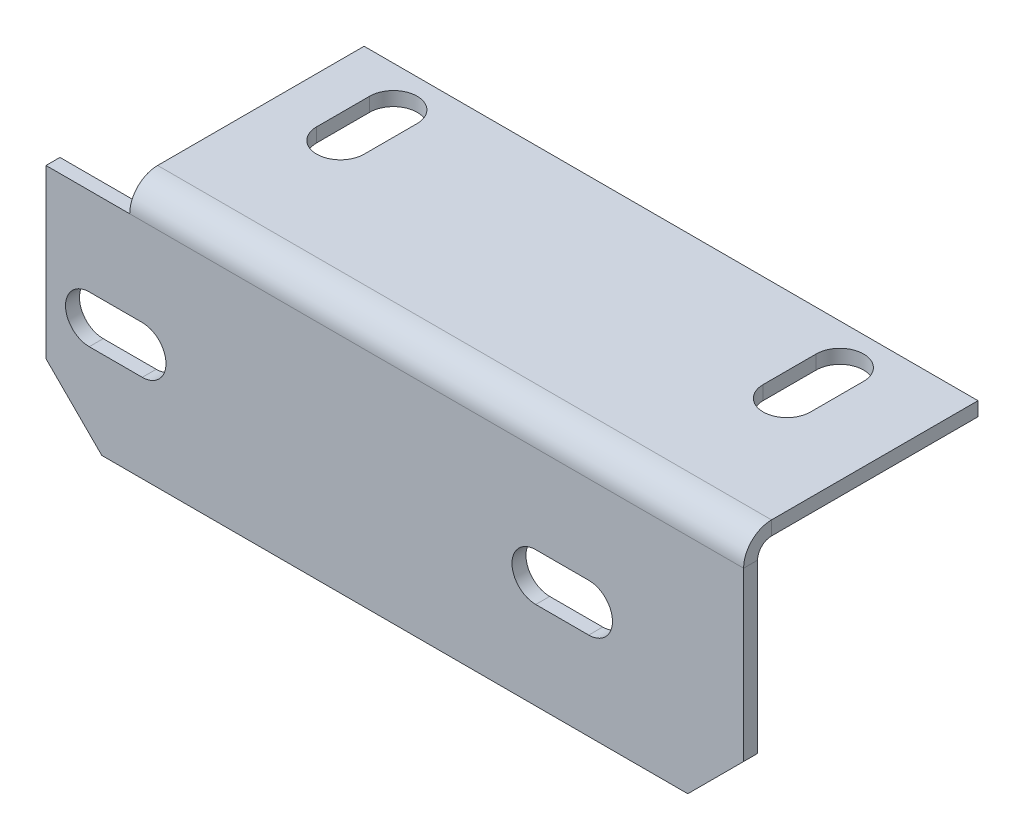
ISO-10303-21;
HEADER;
FILE_DESCRIPTION(('STEP AP214'),'2;1');
FILE_NAME('part.step','',(''),(''),'','','');
FILE_SCHEMA(('AUTOMOTIVE_DESIGN { 1 0 10303 214 1 1 1 1 }'));
ENDSEC;
DATA;
#1=APPLICATION_CONTEXT('core data for automotive mechanical design processes');
#2=APPLICATION_PROTOCOL_DEFINITION('international standard','automotive_design',2000,#1);
#3=PRODUCT_CONTEXT('',#1,'mechanical');
#4=PRODUCT('Part','Part','',(#3));
#5=PRODUCT_RELATED_PRODUCT_CATEGORY('part','',(#4));
#6=PRODUCT_DEFINITION_FORMATION('','',#4);
#7=PRODUCT_DEFINITION_CONTEXT('part definition',#1,'design');
#8=PRODUCT_DEFINITION('design','',#6,#7);
#9=PRODUCT_DEFINITION_SHAPE('','',#8);
#10=(LENGTH_UNIT() NAMED_UNIT(*) SI_UNIT(.MILLI.,.METRE.));
#11=(NAMED_UNIT(*) PLANE_ANGLE_UNIT() SI_UNIT($,.RADIAN.));
#12=(NAMED_UNIT(*) SI_UNIT($,.STERADIAN.) SOLID_ANGLE_UNIT());
#13=UNCERTAINTY_MEASURE_WITH_UNIT(LENGTH_MEASURE(1.E-05),#10,'distance_accuracy_value','');
#14=(GEOMETRIC_REPRESENTATION_CONTEXT(3) GLOBAL_UNCERTAINTY_ASSIGNED_CONTEXT((#13)) GLOBAL_UNIT_ASSIGNED_CONTEXT((#10,
#11,#12)) REPRESENTATION_CONTEXT('',''));
#15=CARTESIAN_POINT('',(0.,0.,0.));
#16=DIRECTION('',(0.,0.,1.));
#17=DIRECTION('',(1.,0.,0.));
#18=AXIS2_PLACEMENT_3D('',#15,#16,#17);
#19=CARTESIAN_POINT('',(62.4999999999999,45.,-5.00000000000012));
#20=DIRECTION('',(1.,0.,0.));
#21=DIRECTION('',(0.,0.,-1.));
#22=AXIS2_PLACEMENT_3D('',#19,#20,#21);
#23=PLANE('',#22);
#24=DIRECTION('',(0.,-1.,0.));
#25=VECTOR('',#24,1.);
#26=CARTESIAN_POINT('',(62.4999999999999,45.,-5.00000000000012));
#27=LINE('',#26,#25);
#28=CARTESIAN_POINT('',(62.4999999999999,45.,-5.00000000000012));
#29=VERTEX_POINT('',#28);
#30=CARTESIAN_POINT('',(62.4999999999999,42.5,-4.99999999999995));
#31=VERTEX_POINT('',#30);
#32=EDGE_CURVE('E273',#29,#31,#27,.T.);
#33=ORIENTED_EDGE('',*,*,#32,.F.);
#34=CARTESIAN_POINT('',(62.4999999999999,40.,-4.99999999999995));
#35=DIRECTION('',(1.,0.,0.));
#36=DIRECTION('',(0.,0.,-1.));
#37=AXIS2_PLACEMENT_3D('',#34,#35,#36);
#38=CIRCLE('',#37,5.);
#39=CARTESIAN_POINT('',(62.5,39.9999999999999,0.));
#40=VERTEX_POINT('',#39);
#41=EDGE_CURVE('E358',#40,#29,#38,.F.);
#42=ORIENTED_EDGE('',*,*,#41,.F.);
#43=DIRECTION('',(0.,0.,1.));
#44=VECTOR('',#43,1.);
#45=CARTESIAN_POINT('',(62.5,40.,-2.49999999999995));
#46=LINE('',#45,#44);
#47=CARTESIAN_POINT('',(62.5,40.,-2.49999999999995));
#48=VERTEX_POINT('',#47);
#49=EDGE_CURVE('E269',#48,#40,#46,.T.);
#50=ORIENTED_EDGE('',*,*,#49,.F.);
#51=CARTESIAN_POINT('',(62.4999999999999,40.,-4.99999999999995));
#52=DIRECTION('',(1.,0.,0.));
#53=DIRECTION('',(0.,0.,-1.));
#54=AXIS2_PLACEMENT_3D('',#51,#52,#53);
#55=CIRCLE('',#54,2.5);
#56=EDGE_CURVE('E348',#48,#31,#55,.F.);
#57=ORIENTED_EDGE('',*,*,#56,.T.);
#58=EDGE_LOOP('',(#33,#42,#50,#57));
#59=FACE_BOUND('',#58,.T.);
#60=ADVANCED_FACE('F44',(#59),#23,.T.);
#61=CARTESIAN_POINT('',(62.5,40.,-2.49999999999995));
#62=DIRECTION('',(1.,0.,0.));
#63=DIRECTION('',(0.,0.,-1.));
#64=AXIS2_PLACEMENT_3D('',#61,#62,#63);
#65=PLANE('',#64);
#66=DIRECTION('',(0.,0.,-1.));
#67=VECTOR('',#66,1.);
#68=CARTESIAN_POINT('',(62.5,45.,-1.11022302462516E-13));
#69=LINE('',#68,#67);
#70=CARTESIAN_POINT('',(62.4999999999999,45.,-42.0000000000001));
#71=VERTEX_POINT('',#70);
#72=EDGE_CURVE('E252',#29,#71,#69,.T.);
#73=ORIENTED_EDGE('',*,*,#72,.F.);
#74=ORIENTED_EDGE('',*,*,#32,.T.);
#75=DIRECTION('',(0.,0.,-1.));
#76=VECTOR('',#75,1.);
#77=CARTESIAN_POINT('',(62.5,42.5,0.));
#78=LINE('',#77,#76);
#79=CARTESIAN_POINT('',(62.4999999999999,42.5,-42.));
#80=VERTEX_POINT('',#79);
#81=EDGE_CURVE('E318',#31,#80,#78,.T.);
#82=ORIENTED_EDGE('',*,*,#81,.T.);
#83=DIRECTION('',(0.,-1.,0.));
#84=VECTOR('',#83,1.);
#85=CARTESIAN_POINT('',(62.4999999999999,45.,-42.0000000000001));
#86=LINE('',#85,#84);
#87=EDGE_CURVE('E364',#71,#80,#86,.T.);
#88=ORIENTED_EDGE('',*,*,#87,.F.);
#89=EDGE_LOOP('',(#73,#74,#82,#88));
#90=FACE_BOUND('',#89,.T.);
#91=ADVANCED_FACE('F568',(#90),#65,.T.);
#92=CARTESIAN_POINT('',(-62.5,42.5,-4.99999999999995));
#93=DIRECTION('',(-1.,0.,0.));
#94=DIRECTION('',(0.,0.,1.));
#95=AXIS2_PLACEMENT_3D('',#92,#93,#94);
#96=PLANE('',#95);
#97=DIRECTION('',(0.,1.,0.));
#98=VECTOR('',#97,1.);
#99=CARTESIAN_POINT('',(-62.5,0.,-2.5));
#100=LINE('',#99,#98);
#101=CARTESIAN_POINT('',(-62.5,10.,-2.5));
#102=VERTEX_POINT('',#101);
#103=CARTESIAN_POINT('',(-62.5,40.,-2.49999999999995));
#104=VERTEX_POINT('',#103);
#105=EDGE_CURVE('E307',#102,#104,#100,.T.);
#106=ORIENTED_EDGE('',*,*,#105,.F.);
#107=DIRECTION('',(0.,0.,1.));
#108=VECTOR('',#107,1.);
#109=CARTESIAN_POINT('',(-62.5,10.,-4.99999999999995));
#110=LINE('',#109,#108);
#111=CARTESIAN_POINT('',(-62.5,10.,0.));
#112=VERTEX_POINT('',#111);
#113=EDGE_CURVE('E289',#102,#112,#110,.T.);
#114=ORIENTED_EDGE('',*,*,#113,.T.);
#115=DIRECTION('',(0.,1.,0.));
#116=VECTOR('',#115,1.);
#117=CARTESIAN_POINT('',(-62.5,0.,0.));
#118=LINE('',#117,#116);
#119=CARTESIAN_POINT('',(-62.5,40.,0.));
#120=VERTEX_POINT('',#119);
#121=EDGE_CURVE('E319',#112,#120,#118,.T.);
#122=ORIENTED_EDGE('',*,*,#121,.T.);
#123=DIRECTION('',(0.,0.,-1.));
#124=VECTOR('',#123,1.);
#125=CARTESIAN_POINT('',(-62.5,39.9999999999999,0.));
#126=LINE('',#125,#124);
#127=EDGE_CURVE('E259',#120,#104,#126,.T.);
#128=ORIENTED_EDGE('',*,*,#127,.T.);
#129=EDGE_LOOP('',(#106,#114,#122,#128));
#130=FACE_BOUND('',#129,.T.);
#131=ADVANCED_FACE('F314',(#130),#96,.T.);
#132=CARTESIAN_POINT('',(62.5,42.5,0.));
#133=DIRECTION('',(0.,1.,0.));
#134=DIRECTION('',(0.,0.,1.));
#135=AXIS2_PLACEMENT_3D('',#132,#133,#134);
#136=PLANE('',#135);
#137=DIRECTION('',(0.,0.,1.));
#138=VECTOR('',#137,1.);
#139=CARTESIAN_POINT('',(-30.75,42.5,-34.7500000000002));
#140=LINE('',#139,#138);
#141=CARTESIAN_POINT('',(-30.75,42.5,-34.7500000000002));
#142=VERTEX_POINT('',#141);
#143=CARTESIAN_POINT('',(-30.75,42.5,-25.2500000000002));
#144=VERTEX_POINT('',#143);
#145=EDGE_CURVE('E523',#142,#144,#140,.T.);
#146=ORIENTED_EDGE('',*,*,#145,.F.);
#147=CARTESIAN_POINT('',(-35.,42.5,-34.75));
#148=DIRECTION('',(0.,-1.,0.));
#149=DIRECTION('',(0.,0.,1.));
#150=AXIS2_PLACEMENT_3D('',#147,#148,#149);
#151=CIRCLE('',#150,4.25);
#152=CARTESIAN_POINT('',(-39.25,42.5,-34.75));
#153=VERTEX_POINT('',#152);
#154=EDGE_CURVE('E67',#153,#142,#151,.T.);
#155=ORIENTED_EDGE('',*,*,#154,.F.);
#156=DIRECTION('',(0.,0.,-1.));
#157=VECTOR('',#156,1.);
#158=CARTESIAN_POINT('',(-39.25,42.5,-34.75));
#159=LINE('',#158,#157);
#160=CARTESIAN_POINT('',(-39.25,42.5,-25.25));
#161=VERTEX_POINT('',#160);
#162=EDGE_CURVE('E508',#161,#153,#159,.T.);
#163=ORIENTED_EDGE('',*,*,#162,.F.);
#164=CARTESIAN_POINT('',(-35.,42.5,-25.25));
#165=DIRECTION('',(0.,-1.,0.));
#166=DIRECTION('',(0.,0.,-1.));
#167=AXIS2_PLACEMENT_3D('',#164,#165,#166);
#168=CIRCLE('',#167,4.25);
#169=EDGE_CURVE('E519',#144,#161,#168,.T.);
#170=ORIENTED_EDGE('',*,*,#169,.F.);
#171=EDGE_LOOP('',(#146,#155,#163,#170));
#172=FACE_BOUND('',#171,.T.);
#173=DIRECTION('',(0.,0.,1.));
#174=VECTOR('',#173,1.);
#175=CARTESIAN_POINT('',(49.2499999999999,42.5,-34.7500000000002));
#176=LINE('',#175,#174);
#177=CARTESIAN_POINT('',(49.2499999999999,42.5,-34.7500000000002));
#178=VERTEX_POINT('',#177);
#179=CARTESIAN_POINT('',(49.25,42.5,-25.2500000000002));
#180=VERTEX_POINT('',#179);
#181=EDGE_CURVE('E438',#178,#180,#176,.T.);
#182=ORIENTED_EDGE('',*,*,#181,.F.);
#183=CARTESIAN_POINT('',(44.9999999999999,42.5,-34.75));
#184=DIRECTION('',(0.,-1.,0.));
#185=DIRECTION('',(0.,0.,1.));
#186=AXIS2_PLACEMENT_3D('',#183,#184,#185);
#187=CIRCLE('',#186,4.25);
#188=CARTESIAN_POINT('',(40.7499999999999,42.5,-34.7500000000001));
#189=VERTEX_POINT('',#188);
#190=EDGE_CURVE('E442',#189,#178,#187,.T.);
#191=ORIENTED_EDGE('',*,*,#190,.F.);
#192=DIRECTION('',(0.,0.,-1.));
#193=VECTOR('',#192,1.);
#194=CARTESIAN_POINT('',(40.7499999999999,42.5,-34.7500000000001));
#195=LINE('',#194,#193);
#196=CARTESIAN_POINT('',(40.75,42.5,-25.25));
#197=VERTEX_POINT('',#196);
#198=EDGE_CURVE('E424',#197,#189,#195,.T.);
#199=ORIENTED_EDGE('',*,*,#198,.F.);
#200=CARTESIAN_POINT('',(45.,42.5,-25.25));
#201=DIRECTION('',(0.,-1.,0.));
#202=DIRECTION('',(0.,0.,-1.));
#203=AXIS2_PLACEMENT_3D('',#200,#201,#202);
#204=CIRCLE('',#203,4.25);
#205=EDGE_CURVE('E434',#180,#197,#204,.T.);
#206=ORIENTED_EDGE('',*,*,#205,.F.);
#207=EDGE_LOOP('',(#182,#191,#199,#206));
#208=FACE_BOUND('',#207,.T.);
#209=DIRECTION('',(-1.,0.,0.));
#210=VECTOR('',#209,1.);
#211=CARTESIAN_POINT('',(62.4999999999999,42.5,-4.99999999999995));
#212=LINE('',#211,#210);
#213=CARTESIAN_POINT('',(-47.5,42.5,-5.));
#214=VERTEX_POINT('',#213);
#215=EDGE_CURVE('E344',#31,#214,#212,.T.);
#216=ORIENTED_EDGE('',*,*,#215,.T.);
#217=DIRECTION('',(0.,0.,-1.));
#218=VECTOR('',#217,1.);
#219=CARTESIAN_POINT('',(-47.5,42.5,0.));
#220=LINE('',#219,#218);
#221=CARTESIAN_POINT('',(-47.5,42.5,-42.));
#222=VERTEX_POINT('',#221);
#223=EDGE_CURVE('E246',#214,#222,#220,.T.);
#224=ORIENTED_EDGE('',*,*,#223,.T.);
#225=DIRECTION('',(-1.,0.,0.));
#226=VECTOR('',#225,1.);
#227=CARTESIAN_POINT('',(62.4999999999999,42.5,-42.));
#228=LINE('',#227,#226);
#229=EDGE_CURVE('E244',#80,#222,#228,.T.);
#230=ORIENTED_EDGE('',*,*,#229,.F.);
#231=ORIENTED_EDGE('',*,*,#81,.F.);
#232=EDGE_LOOP('',(#216,#224,#230,#231));
#233=FACE_BOUND('',#232,.T.);
#234=ADVANCED_FACE('F566',(#172,#208,#233),#136,.F.);
#235=CARTESIAN_POINT('',(62.4999999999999,45.,-42.0000000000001));
#236=DIRECTION('',(0.,0.,-1.));
#237=DIRECTION('',(-1.,0.,0.));
#238=AXIS2_PLACEMENT_3D('',#235,#236,#237);
#239=PLANE('',#238);
#240=DIRECTION('',(0.,1.,0.));
#241=VECTOR('',#240,1.);
#242=CARTESIAN_POINT('',(-47.5,40.,-42.));
#243=LINE('',#242,#241);
#244=CARTESIAN_POINT('',(-47.5,45.,-42.));
#245=VERTEX_POINT('',#244);
#246=EDGE_CURVE('E226',#222,#245,#243,.T.);
#247=ORIENTED_EDGE('',*,*,#246,.T.);
#248=DIRECTION('',(-1.,0.,0.));
#249=VECTOR('',#248,1.);
#250=CARTESIAN_POINT('',(62.4999999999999,45.,-42.0000000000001));
#251=LINE('',#250,#249);
#252=EDGE_CURVE('E241',#71,#245,#251,.T.);
#253=ORIENTED_EDGE('',*,*,#252,.F.);
#254=ORIENTED_EDGE('',*,*,#87,.T.);
#255=ORIENTED_EDGE('',*,*,#229,.T.);
#256=EDGE_LOOP('',(#247,#253,#254,#255));
#257=FACE_BOUND('',#256,.T.);
#258=ADVANCED_FACE('F239',(#257),#239,.T.);
#259=CARTESIAN_POINT('',(62.5,45.,-1.11022302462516E-13));
#260=DIRECTION('',(0.,1.,0.));
#261=DIRECTION('',(0.,0.,1.));
#262=AXIS2_PLACEMENT_3D('',#259,#260,#261);
#263=PLANE('',#262);
#264=DIRECTION('',(0.,0.,-1.));
#265=VECTOR('',#264,1.);
#266=CARTESIAN_POINT('',(-47.5,45.,-42.));
#267=LINE('',#266,#265);
#268=CARTESIAN_POINT('',(-47.5,45.,-5.));
#269=VERTEX_POINT('',#268);
#270=EDGE_CURVE('E223',#269,#245,#267,.T.);
#271=ORIENTED_EDGE('',*,*,#270,.F.);
#272=DIRECTION('',(-1.,0.,0.));
#273=VECTOR('',#272,1.);
#274=CARTESIAN_POINT('',(62.4999999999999,45.,-5.00000000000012));
#275=LINE('',#274,#273);
#276=EDGE_CURVE('E254',#29,#269,#275,.T.);
#277=ORIENTED_EDGE('',*,*,#276,.F.);
#278=ORIENTED_EDGE('',*,*,#72,.T.);
#279=ORIENTED_EDGE('',*,*,#252,.T.);
#280=EDGE_LOOP('',(#271,#277,#278,#279));
#281=FACE_BOUND('',#280,.T.);
#282=CARTESIAN_POINT('',(-35.,45.,-34.75));
#283=DIRECTION('',(0.,1.,0.));
#284=DIRECTION('',(0.,0.,1.));
#285=AXIS2_PLACEMENT_3D('',#282,#283,#284);
#286=CIRCLE('',#285,4.25);
#287=CARTESIAN_POINT('',(-39.25,45.,-34.75));
#288=VERTEX_POINT('',#287);
#289=CARTESIAN_POINT('',(-30.75,45.,-34.7500000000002));
#290=VERTEX_POINT('',#289);
#291=EDGE_CURVE('E529',#288,#290,#286,.F.);
#292=ORIENTED_EDGE('',*,*,#291,.T.);
#293=DIRECTION('',(0.,0.,1.));
#294=VECTOR('',#293,1.);
#295=CARTESIAN_POINT('',(-30.75,45.,-34.7500000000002));
#296=LINE('',#295,#294);
#297=CARTESIAN_POINT('',(-30.7500000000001,45.,-25.2500000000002));
#298=VERTEX_POINT('',#297);
#299=EDGE_CURVE('E499',#290,#298,#296,.T.);
#300=ORIENTED_EDGE('',*,*,#299,.T.);
#301=CARTESIAN_POINT('',(-35.,45.,-25.25));
#302=DIRECTION('',(0.,1.,0.));
#303=DIRECTION('',(0.,0.,1.));
#304=AXIS2_PLACEMENT_3D('',#301,#302,#303);
#305=CIRCLE('',#304,4.25);
#306=CARTESIAN_POINT('',(-39.25,45.,-25.25));
#307=VERTEX_POINT('',#306);
#308=EDGE_CURVE('E535',#298,#307,#305,.F.);
#309=ORIENTED_EDGE('',*,*,#308,.T.);
#310=DIRECTION('',(0.,0.,-1.));
#311=VECTOR('',#310,1.);
#312=CARTESIAN_POINT('',(-39.25,45.,-34.75));
#313=LINE('',#312,#311);
#314=EDGE_CURVE('E532',#307,#288,#313,.T.);
#315=ORIENTED_EDGE('',*,*,#314,.T.);
#316=EDGE_LOOP('',(#292,#300,#309,#315));
#317=FACE_BOUND('',#316,.T.);
#318=CARTESIAN_POINT('',(44.9999999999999,45.,-34.75));
#319=DIRECTION('',(0.,1.,0.));
#320=DIRECTION('',(0.,0.,1.));
#321=AXIS2_PLACEMENT_3D('',#318,#319,#320);
#322=CIRCLE('',#321,4.25);
#323=CARTESIAN_POINT('',(40.7499999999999,45.,-34.75));
#324=VERTEX_POINT('',#323);
#325=CARTESIAN_POINT('',(49.2499999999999,45.,-34.7500000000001));
#326=VERTEX_POINT('',#325);
#327=EDGE_CURVE('E445',#324,#326,#322,.F.);
#328=ORIENTED_EDGE('',*,*,#327,.T.);
#329=DIRECTION('',(0.,0.,1.));
#330=VECTOR('',#329,1.);
#331=CARTESIAN_POINT('',(49.2499999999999,45.,-34.7500000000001));
#332=LINE('',#331,#330);
#333=CARTESIAN_POINT('',(49.25,45.,-25.2500000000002));
#334=VERTEX_POINT('',#333);
#335=EDGE_CURVE('E414',#326,#334,#332,.T.);
#336=ORIENTED_EDGE('',*,*,#335,.T.);
#337=CARTESIAN_POINT('',(45.,45.,-25.25));
#338=DIRECTION('',(0.,1.,0.));
#339=DIRECTION('',(0.,0.,1.));
#340=AXIS2_PLACEMENT_3D('',#337,#338,#339);
#341=CIRCLE('',#340,4.25);
#342=CARTESIAN_POINT('',(40.75,45.,-25.25));
#343=VERTEX_POINT('',#342);
#344=EDGE_CURVE('E453',#334,#343,#341,.F.);
#345=ORIENTED_EDGE('',*,*,#344,.T.);
#346=DIRECTION('',(0.,0.,-1.));
#347=VECTOR('',#346,1.);
#348=CARTESIAN_POINT('',(40.7499999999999,45.,-34.75));
#349=LINE('',#348,#347);
#350=EDGE_CURVE('E449',#343,#324,#349,.T.);
#351=ORIENTED_EDGE('',*,*,#350,.T.);
#352=EDGE_LOOP('',(#328,#336,#345,#351));
#353=FACE_BOUND('',#352,.T.);
#354=ADVANCED_FACE('F249',(#281,#317,#353),#263,.T.);
#355=CARTESIAN_POINT('',(62.4999999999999,40.,-4.99999999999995));
#356=DIRECTION('',(-1.,0.,0.));
#357=DIRECTION('',(0.,0.,1.));
#358=AXIS2_PLACEMENT_3D('',#355,#356,#357);
#359=CYLINDRICAL_SURFACE('',#358,5.);
#360=CARTESIAN_POINT('',(-47.5,40.,-5.));
#361=DIRECTION('',(1.,0.,0.));
#362=DIRECTION('',(0.,0.,-1.));
#363=AXIS2_PLACEMENT_3D('',#360,#361,#362);
#364=CIRCLE('',#363,5.);
#365=CARTESIAN_POINT('',(-47.5,40.,0.));
#366=VERTEX_POINT('',#365);
#367=EDGE_CURVE('E229',#366,#269,#364,.F.);
#368=ORIENTED_EDGE('',*,*,#367,.F.);
#369=DIRECTION('',(-1.,0.,0.));
#370=VECTOR('',#369,1.);
#371=CARTESIAN_POINT('',(62.5,39.9999999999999,0.));
#372=LINE('',#371,#370);
#373=EDGE_CURVE('E262',#40,#366,#372,.T.);
#374=ORIENTED_EDGE('',*,*,#373,.F.);
#375=ORIENTED_EDGE('',*,*,#41,.T.);
#376=ORIENTED_EDGE('',*,*,#276,.T.);
#377=EDGE_LOOP('',(#368,#374,#375,#376));
#378=FACE_BOUND('',#377,.T.);
#379=ADVANCED_FACE('F549',(#378),#359,.T.);
#380=CARTESIAN_POINT('',(62.5,0.,0.));
#381=DIRECTION('',(0.,0.,1.));
#382=DIRECTION('',(1.,0.,0.));
#383=AXIS2_PLACEMENT_3D('',#380,#381,#382);
#384=PLANE('',#383);
#385=CARTESIAN_POINT('',(25.25,20.,0.));
#386=DIRECTION('',(0.,0.,1.));
#387=DIRECTION('',(-1.,0.,0.));
#388=AXIS2_PLACEMENT_3D('',#385,#386,#387);
#389=CIRCLE('',#388,4.25);
#390=CARTESIAN_POINT('',(25.25,24.25,0.));
#391=VERTEX_POINT('',#390);
#392=CARTESIAN_POINT('',(25.25,15.75,0.));
#393=VERTEX_POINT('',#392);
#394=EDGE_CURVE('E485',#391,#393,#389,.T.);
#395=ORIENTED_EDGE('',*,*,#394,.F.);
#396=DIRECTION('',(-1.,0.,0.));
#397=VECTOR('',#396,1.);
#398=CARTESIAN_POINT('',(25.25,24.25,0.));
#399=LINE('',#398,#397);
#400=CARTESIAN_POINT('',(34.75,24.25,-1.66533453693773E-13));
#401=VERTEX_POINT('',#400);
#402=EDGE_CURVE('E467',#401,#391,#399,.T.);
#403=ORIENTED_EDGE('',*,*,#402,.F.);
#404=CARTESIAN_POINT('',(34.75,20.,-1.66533453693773E-13));
#405=DIRECTION('',(0.,0.,1.));
#406=DIRECTION('',(1.,0.,0.));
#407=AXIS2_PLACEMENT_3D('',#404,#405,#406);
#408=CIRCLE('',#407,4.25);
#409=CARTESIAN_POINT('',(34.75,15.75,-1.66533453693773E-13));
#410=VERTEX_POINT('',#409);
#411=EDGE_CURVE('E478',#410,#401,#408,.T.);
#412=ORIENTED_EDGE('',*,*,#411,.F.);
#413=DIRECTION('',(1.,0.,0.));
#414=VECTOR('',#413,1.);
#415=CARTESIAN_POINT('',(25.25,15.75,0.));
#416=LINE('',#415,#414);
#417=EDGE_CURVE('E482',#393,#410,#416,.T.);
#418=ORIENTED_EDGE('',*,*,#417,.F.);
#419=EDGE_LOOP('',(#395,#403,#412,#418));
#420=FACE_BOUND('',#419,.T.);
#421=CARTESIAN_POINT('',(-54.75,20.,0.));
#422=DIRECTION('',(0.,0.,1.));
#423=DIRECTION('',(-1.,0.,0.));
#424=AXIS2_PLACEMENT_3D('',#421,#422,#423);
#425=CIRCLE('',#424,4.25);
#426=CARTESIAN_POINT('',(-54.75,24.25,0.));
#427=VERTEX_POINT('',#426);
#428=CARTESIAN_POINT('',(-54.75,15.75,0.));
#429=VERTEX_POINT('',#428);
#430=EDGE_CURVE('E400',#427,#429,#425,.T.);
#431=ORIENTED_EDGE('',*,*,#430,.F.);
#432=DIRECTION('',(-1.,0.,0.));
#433=VECTOR('',#432,1.);
#434=CARTESIAN_POINT('',(-54.75,24.25,0.));
#435=LINE('',#434,#433);
#436=CARTESIAN_POINT('',(-45.25,24.25,-1.66533453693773E-13));
#437=VERTEX_POINT('',#436);
#438=EDGE_CURVE('E381',#437,#427,#435,.T.);
#439=ORIENTED_EDGE('',*,*,#438,.F.);
#440=CARTESIAN_POINT('',(-45.25,20.,-1.66533453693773E-13));
#441=DIRECTION('',(0.,0.,1.));
#442=DIRECTION('',(1.,0.,0.));
#443=AXIS2_PLACEMENT_3D('',#440,#441,#442);
#444=CIRCLE('',#443,4.25);
#445=CARTESIAN_POINT('',(-45.25,15.75,-1.66533453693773E-13));
#446=VERTEX_POINT('',#445);
#447=EDGE_CURVE('E392',#446,#437,#444,.T.);
#448=ORIENTED_EDGE('',*,*,#447,.F.);
#449=DIRECTION('',(1.,0.,0.));
#450=VECTOR('',#449,1.);
#451=CARTESIAN_POINT('',(-54.75,15.75,0.));
#452=LINE('',#451,#450);
#453=EDGE_CURVE('E396',#429,#446,#452,.T.);
#454=ORIENTED_EDGE('',*,*,#453,.F.);
#455=EDGE_LOOP('',(#431,#439,#448,#454));
#456=FACE_BOUND('',#455,.T.);
#457=ORIENTED_EDGE('',*,*,#121,.F.);
#458=DIRECTION('',(-0.707106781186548,0.707106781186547,0.));
#459=VECTOR('',#458,1.);
#460=CARTESIAN_POINT('',(5.00000000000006,-57.4999999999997,-1.11022302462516E-13));
#461=LINE('',#460,#459);
#462=CARTESIAN_POINT('',(-52.5,0.,0.));
#463=VERTEX_POINT('',#462);
#464=EDGE_CURVE('E293',#112,#463,#461,.F.);
#465=ORIENTED_EDGE('',*,*,#464,.T.);
#466=DIRECTION('',(-1.,0.,0.));
#467=VECTOR('',#466,1.);
#468=CARTESIAN_POINT('',(62.5,0.,0.));
#469=LINE('',#468,#467);
#470=CARTESIAN_POINT('',(52.5,0.,-1.66533453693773E-13));
#471=VERTEX_POINT('',#470);
#472=EDGE_CURVE('E326',#471,#463,#469,.T.);
#473=ORIENTED_EDGE('',*,*,#472,.F.);
#474=DIRECTION('',(-0.707106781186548,-0.707106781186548,0.));
#475=VECTOR('',#474,1.);
#476=CARTESIAN_POINT('',(57.5,5.,0.));
#477=LINE('',#476,#475);
#478=CARTESIAN_POINT('',(62.5,10.,0.));
#479=VERTEX_POINT('',#478);
#480=EDGE_CURVE('E280',#471,#479,#477,.F.);
#481=ORIENTED_EDGE('',*,*,#480,.T.);
#482=DIRECTION('',(0.,1.,0.));
#483=VECTOR('',#482,1.);
#484=CARTESIAN_POINT('',(62.5,0.,0.));
#485=LINE('',#484,#483);
#486=EDGE_CURVE('E355',#479,#40,#485,.T.);
#487=ORIENTED_EDGE('',*,*,#486,.T.);
#488=ORIENTED_EDGE('',*,*,#373,.T.);
#489=DIRECTION('',(1.,0.,0.));
#490=VECTOR('',#489,1.);
#491=CARTESIAN_POINT('',(-62.5,40.,0.));
#492=LINE('',#491,#490);
#493=EDGE_CURVE('E235',#120,#366,#492,.T.);
#494=ORIENTED_EDGE('',*,*,#493,.F.);
#495=EDGE_LOOP('',(#457,#465,#473,#481,#487,#488,#494));
#496=FACE_BOUND('',#495,.T.);
#497=ADVANCED_FACE('F325',(#420,#456,#496),#384,.T.);
#498=CARTESIAN_POINT('',(62.5,0.,-2.5));
#499=DIRECTION('',(0.,-1.,0.));
#500=DIRECTION('',(0.,0.,-1.));
#501=AXIS2_PLACEMENT_3D('',#498,#499,#500);
#502=PLANE('',#501);
#503=ORIENTED_EDGE('',*,*,#472,.T.);
#504=DIRECTION('',(0.,0.,-1.));
#505=VECTOR('',#504,1.);
#506=CARTESIAN_POINT('',(-52.5,0.,-2.5));
#507=LINE('',#506,#505);
#508=CARTESIAN_POINT('',(-52.5,0.,-2.5));
#509=VERTEX_POINT('',#508);
#510=EDGE_CURVE('E296',#463,#509,#507,.T.);
#511=ORIENTED_EDGE('',*,*,#510,.T.);
#512=DIRECTION('',(-1.,0.,0.));
#513=VECTOR('',#512,1.);
#514=CARTESIAN_POINT('',(62.5,0.,-2.5));
#515=LINE('',#514,#513);
#516=CARTESIAN_POINT('',(52.5,0.,-2.50000000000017));
#517=VERTEX_POINT('',#516);
#518=EDGE_CURVE('E309',#517,#509,#515,.T.);
#519=ORIENTED_EDGE('',*,*,#518,.F.);
#520=DIRECTION('',(0.,0.,1.));
#521=VECTOR('',#520,1.);
#522=CARTESIAN_POINT('',(52.5,0.,-2.50000000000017));
#523=LINE('',#522,#521);
#524=EDGE_CURVE('E276',#517,#471,#523,.T.);
#525=ORIENTED_EDGE('',*,*,#524,.T.);
#526=EDGE_LOOP('',(#503,#511,#519,#525));
#527=FACE_BOUND('',#526,.T.);
#528=ADVANCED_FACE('F329',(#527),#502,.T.);
#529=CARTESIAN_POINT('',(62.5,0.,-2.5));
#530=DIRECTION('',(0.,0.,1.));
#531=DIRECTION('',(1.,0.,0.));
#532=AXIS2_PLACEMENT_3D('',#529,#530,#531);
#533=PLANE('',#532);
#534=DIRECTION('',(1.,0.,0.));
#535=VECTOR('',#534,1.);
#536=CARTESIAN_POINT('',(25.25,24.25,-2.5));
#537=LINE('',#536,#535);
#538=CARTESIAN_POINT('',(25.25,24.25,-2.5));
#539=VERTEX_POINT('',#538);
#540=CARTESIAN_POINT('',(34.75,24.25,-2.50000000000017));
#541=VERTEX_POINT('',#540);
#542=EDGE_CURVE('E492',#539,#541,#537,.T.);
#543=ORIENTED_EDGE('',*,*,#542,.F.);
#544=CARTESIAN_POINT('',(25.25,20.,-2.5));
#545=DIRECTION('',(0.,0.,1.));
#546=DIRECTION('',(1.,0.,0.));
#547=AXIS2_PLACEMENT_3D('',#544,#545,#546);
#548=CIRCLE('',#547,4.25);
#549=CARTESIAN_POINT('',(25.25,15.75,-2.5));
#550=VERTEX_POINT('',#549);
#551=EDGE_CURVE('E488',#550,#539,#548,.F.);
#552=ORIENTED_EDGE('',*,*,#551,.F.);
#553=DIRECTION('',(-1.,0.,0.));
#554=VECTOR('',#553,1.);
#555=CARTESIAN_POINT('',(25.25,15.75,-2.5));
#556=LINE('',#555,#554);
#557=CARTESIAN_POINT('',(34.75,15.75,-2.50000000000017));
#558=VERTEX_POINT('',#557);
#559=EDGE_CURVE('E457',#558,#550,#556,.T.);
#560=ORIENTED_EDGE('',*,*,#559,.F.);
#561=CARTESIAN_POINT('',(34.75,20.,-2.50000000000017));
#562=DIRECTION('',(0.,0.,1.));
#563=DIRECTION('',(1.,0.,0.));
#564=AXIS2_PLACEMENT_3D('',#561,#562,#563);
#565=CIRCLE('',#564,4.25);
#566=EDGE_CURVE('E496',#541,#558,#565,.F.);
#567=ORIENTED_EDGE('',*,*,#566,.F.);
#568=EDGE_LOOP('',(#543,#552,#560,#567));
#569=FACE_BOUND('',#568,.T.);
#570=DIRECTION('',(1.,0.,0.));
#571=VECTOR('',#570,1.);
#572=CARTESIAN_POINT('',(-54.75,24.25,-2.5));
#573=LINE('',#572,#571);
#574=CARTESIAN_POINT('',(-54.75,24.25,-2.5));
#575=VERTEX_POINT('',#574);
#576=CARTESIAN_POINT('',(-45.25,24.25,-2.50000000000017));
#577=VERTEX_POINT('',#576);
#578=EDGE_CURVE('E407',#575,#577,#573,.T.);
#579=ORIENTED_EDGE('',*,*,#578,.F.);
#580=CARTESIAN_POINT('',(-54.75,20.,-2.5));
#581=DIRECTION('',(0.,0.,1.));
#582=DIRECTION('',(1.,0.,0.));
#583=AXIS2_PLACEMENT_3D('',#580,#581,#582);
#584=CIRCLE('',#583,4.25);
#585=CARTESIAN_POINT('',(-54.75,15.75,-2.5));
#586=VERTEX_POINT('',#585);
#587=EDGE_CURVE('E403',#586,#575,#584,.F.);
#588=ORIENTED_EDGE('',*,*,#587,.F.);
#589=DIRECTION('',(-1.,0.,0.));
#590=VECTOR('',#589,1.);
#591=CARTESIAN_POINT('',(-54.75,15.75,-2.5));
#592=LINE('',#591,#590);
#593=CARTESIAN_POINT('',(-45.25,15.75,-2.50000000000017));
#594=VERTEX_POINT('',#593);
#595=EDGE_CURVE('E371',#594,#586,#592,.T.);
#596=ORIENTED_EDGE('',*,*,#595,.F.);
#597=CARTESIAN_POINT('',(-45.25,20.,-2.50000000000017));
#598=DIRECTION('',(0.,0.,1.));
#599=DIRECTION('',(1.,0.,0.));
#600=AXIS2_PLACEMENT_3D('',#597,#598,#599);
#601=CIRCLE('',#600,4.25);
#602=EDGE_CURVE('E411',#577,#594,#601,.F.);
#603=ORIENTED_EDGE('',*,*,#602,.F.);
#604=EDGE_LOOP('',(#579,#588,#596,#603));
#605=FACE_BOUND('',#604,.T.);
#606=ORIENTED_EDGE('',*,*,#518,.T.);
#607=DIRECTION('',(0.707106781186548,-0.707106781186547,0.));
#608=VECTOR('',#607,1.);
#609=CARTESIAN_POINT('',(-62.5,10.,-2.5));
#610=LINE('',#609,#608);
#611=EDGE_CURVE('E52',#509,#102,#610,.F.);
#612=ORIENTED_EDGE('',*,*,#611,.T.);
#613=ORIENTED_EDGE('',*,*,#105,.T.);
#614=DIRECTION('',(-1.,0.,0.));
#615=VECTOR('',#614,1.);
#616=CARTESIAN_POINT('',(62.5,40.,-2.49999999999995));
#617=LINE('',#616,#615);
#618=CARTESIAN_POINT('',(-47.5,39.9999999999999,-2.5));
#619=VERTEX_POINT('',#618);
#620=EDGE_CURVE('E343',#619,#104,#617,.T.);
#621=ORIENTED_EDGE('',*,*,#620,.F.);
#622=EDGE_CURVE('E337',#48,#619,#617,.T.);
#623=ORIENTED_EDGE('',*,*,#622,.F.);
#624=DIRECTION('',(0.,1.,0.));
#625=VECTOR('',#624,1.);
#626=CARTESIAN_POINT('',(62.5,0.,-2.5));
#627=LINE('',#626,#625);
#628=CARTESIAN_POINT('',(62.5,10.,-2.5));
#629=VERTEX_POINT('',#628);
#630=EDGE_CURVE('E352',#629,#48,#627,.T.);
#631=ORIENTED_EDGE('',*,*,#630,.F.);
#632=DIRECTION('',(0.707106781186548,0.707106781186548,0.));
#633=VECTOR('',#632,1.);
#634=CARTESIAN_POINT('',(52.5,0.,-2.50000000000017));
#635=LINE('',#634,#633);
#636=EDGE_CURVE('E286',#629,#517,#635,.F.);
#637=ORIENTED_EDGE('',*,*,#636,.T.);
#638=EDGE_LOOP('',(#606,#612,#613,#621,#623,#631,#637));
#639=FACE_BOUND('',#638,.T.);
#640=ADVANCED_FACE('F305',(#569,#605,#639),#533,.F.);
#641=CARTESIAN_POINT('',(62.4999999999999,40.,-4.99999999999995));
#642=DIRECTION('',(-1.,0.,0.));
#643=DIRECTION('',(0.,0.,1.));
#644=AXIS2_PLACEMENT_3D('',#641,#642,#643);
#645=CYLINDRICAL_SURFACE('',#644,2.5);
#646=ORIENTED_EDGE('',*,*,#622,.T.);
#647=CARTESIAN_POINT('',(-47.5,40.,-5.));
#648=DIRECTION('',(1.,0.,0.));
#649=DIRECTION('',(0.,0.,-1.));
#650=AXIS2_PLACEMENT_3D('',#647,#648,#649);
#651=CIRCLE('',#650,2.5);
#652=EDGE_CURVE('E11',#619,#214,#651,.F.);
#653=ORIENTED_EDGE('',*,*,#652,.T.);
#654=ORIENTED_EDGE('',*,*,#215,.F.);
#655=ORIENTED_EDGE('',*,*,#56,.F.);
#656=EDGE_LOOP('',(#646,#653,#654,#655));
#657=FACE_BOUND('',#656,.T.);
#658=ADVANCED_FACE('F563',(#657),#645,.F.);
#659=CARTESIAN_POINT('',(62.4999999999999,40.,-4.99999999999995));
#660=DIRECTION('',(1.,0.,0.));
#661=DIRECTION('',(0.,0.,-1.));
#662=AXIS2_PLACEMENT_3D('',#659,#660,#661);
#663=PLANE('',#662);
#664=ORIENTED_EDGE('',*,*,#486,.F.);
#665=DIRECTION('',(0.,0.,-1.));
#666=VECTOR('',#665,1.);
#667=CARTESIAN_POINT('',(62.4999999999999,10.,-5.));
#668=LINE('',#667,#666);
#669=EDGE_CURVE('E283',#479,#629,#668,.T.);
#670=ORIENTED_EDGE('',*,*,#669,.T.);
#671=ORIENTED_EDGE('',*,*,#630,.T.);
#672=ORIENTED_EDGE('',*,*,#49,.T.);
#673=EDGE_LOOP('',(#664,#670,#671,#672));
#674=FACE_BOUND('',#673,.T.);
#675=ADVANCED_FACE('F555',(#674),#663,.T.);
#676=CARTESIAN_POINT('',(-54.75,20.,-42.0010000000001));
#677=DIRECTION('',(0.,0.,1.));
#678=DIRECTION('',(1.,0.,0.));
#679=AXIS2_PLACEMENT_3D('',#676,#677,#678);
#680=CYLINDRICAL_SURFACE('',#679,4.25);
#681=ORIENTED_EDGE('',*,*,#587,.T.);
#682=DIRECTION('',(0.,0.,1.));
#683=VECTOR('',#682,1.);
#684=CARTESIAN_POINT('',(-54.75,24.25,-42.0010000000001));
#685=LINE('',#684,#683);
#686=EDGE_CURVE('E375',#575,#427,#685,.T.);
#687=ORIENTED_EDGE('',*,*,#686,.T.);
#688=ORIENTED_EDGE('',*,*,#430,.T.);
#689=DIRECTION('',(0.,0.,1.));
#690=VECTOR('',#689,1.);
#691=CARTESIAN_POINT('',(-54.75,15.75,-42.0010000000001));
#692=LINE('',#691,#690);
#693=EDGE_CURVE('E376',#586,#429,#692,.T.);
#694=ORIENTED_EDGE('',*,*,#693,.F.);
#695=EDGE_LOOP('',(#681,#687,#688,#694));
#696=FACE_BOUND('',#695,.T.);
#697=ADVANCED_FACE('F597',(#696),#680,.F.);
#698=CARTESIAN_POINT('',(-54.75,24.25,-42.0010000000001));
#699=DIRECTION('',(0.,1.,0.));
#700=DIRECTION('',(0.,0.,1.));
#701=AXIS2_PLACEMENT_3D('',#698,#699,#700);
#702=PLANE('',#701);
#703=ORIENTED_EDGE('',*,*,#578,.T.);
#704=DIRECTION('',(0.,0.,1.));
#705=VECTOR('',#704,1.);
#706=CARTESIAN_POINT('',(-45.25,24.25,-42.0010000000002));
#707=LINE('',#706,#705);
#708=EDGE_CURVE('E384',#577,#437,#707,.T.);
#709=ORIENTED_EDGE('',*,*,#708,.T.);
#710=ORIENTED_EDGE('',*,*,#438,.T.);
#711=ORIENTED_EDGE('',*,*,#686,.F.);
#712=EDGE_LOOP('',(#703,#709,#710,#711));
#713=FACE_BOUND('',#712,.T.);
#714=ADVANCED_FACE('F600',(#713),#702,.F.);
#715=CARTESIAN_POINT('',(-45.25,20.,-42.0010000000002));
#716=DIRECTION('',(0.,0.,1.));
#717=DIRECTION('',(1.,0.,0.));
#718=AXIS2_PLACEMENT_3D('',#715,#716,#717);
#719=CYLINDRICAL_SURFACE('',#718,4.25);
#720=ORIENTED_EDGE('',*,*,#602,.T.);
#721=DIRECTION('',(0.,0.,1.));
#722=VECTOR('',#721,1.);
#723=CARTESIAN_POINT('',(-45.25,15.75,-42.0010000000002));
#724=LINE('',#723,#722);
#725=EDGE_CURVE('E380',#594,#446,#724,.T.);
#726=ORIENTED_EDGE('',*,*,#725,.T.);
#727=ORIENTED_EDGE('',*,*,#447,.T.);
#728=ORIENTED_EDGE('',*,*,#708,.F.);
#729=EDGE_LOOP('',(#720,#726,#727,#728));
#730=FACE_BOUND('',#729,.T.);
#731=ADVANCED_FACE('F606',(#730),#719,.F.);
#732=CARTESIAN_POINT('',(-54.75,15.75,-42.0010000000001));
#733=DIRECTION('',(0.,-1.,0.));
#734=DIRECTION('',(0.,0.,-1.));
#735=AXIS2_PLACEMENT_3D('',#732,#733,#734);
#736=PLANE('',#735);
#737=ORIENTED_EDGE('',*,*,#595,.T.);
#738=ORIENTED_EDGE('',*,*,#693,.T.);
#739=ORIENTED_EDGE('',*,*,#453,.T.);
#740=ORIENTED_EDGE('',*,*,#725,.F.);
#741=EDGE_LOOP('',(#737,#738,#739,#740));
#742=FACE_BOUND('',#741,.T.);
#743=ADVANCED_FACE('F602',(#742),#736,.F.);
#744=CARTESIAN_POINT('',(52.5,0.,-2.50000000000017));
#745=DIRECTION('',(-0.707106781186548,0.707106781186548,0.));
#746=DIRECTION('',(-0.707106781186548,-0.707106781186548,0.));
#747=AXIS2_PLACEMENT_3D('',#744,#745,#746);
#748=PLANE('',#747);
#749=ORIENTED_EDGE('',*,*,#636,.F.);
#750=ORIENTED_EDGE('',*,*,#669,.F.);
#751=ORIENTED_EDGE('',*,*,#480,.F.);
#752=ORIENTED_EDGE('',*,*,#524,.F.);
#753=EDGE_LOOP('',(#749,#750,#751,#752));
#754=FACE_BOUND('',#753,.T.);
#755=ADVANCED_FACE('F605',(#754),#748,.F.);
#756=CARTESIAN_POINT('',(-62.5,10.,-4.99999999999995));
#757=DIRECTION('',(0.707106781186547,0.707106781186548,0.));
#758=DIRECTION('',(-0.707106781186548,0.707106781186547,0.));
#759=AXIS2_PLACEMENT_3D('',#756,#757,#758);
#760=PLANE('',#759);
#761=ORIENTED_EDGE('',*,*,#611,.F.);
#762=ORIENTED_EDGE('',*,*,#510,.F.);
#763=ORIENTED_EDGE('',*,*,#464,.F.);
#764=ORIENTED_EDGE('',*,*,#113,.F.);
#765=EDGE_LOOP('',(#761,#762,#763,#764));
#766=FACE_BOUND('',#765,.T.);
#767=ADVANCED_FACE('F321',(#766),#760,.F.);
#768=CARTESIAN_POINT('',(44.9999999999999,45.001,-34.75));
#769=DIRECTION('',(0.,-1.,0.));
#770=DIRECTION('',(0.,0.,-1.));
#771=AXIS2_PLACEMENT_3D('',#768,#769,#770);
#772=CYLINDRICAL_SURFACE('',#771,4.25);
#773=DIRECTION('',(0.,-1.,0.));
#774=VECTOR('',#773,1.);
#775=CARTESIAN_POINT('',(40.7499999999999,45.001,-34.75));
#776=LINE('',#775,#774);
#777=EDGE_CURVE('E418',#324,#189,#776,.T.);
#778=ORIENTED_EDGE('',*,*,#777,.T.);
#779=ORIENTED_EDGE('',*,*,#190,.T.);
#780=DIRECTION('',(0.,-1.,0.));
#781=VECTOR('',#780,1.);
#782=CARTESIAN_POINT('',(49.2499999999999,45.001,-34.7500000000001));
#783=LINE('',#782,#781);
#784=EDGE_CURVE('E419',#326,#178,#783,.T.);
#785=ORIENTED_EDGE('',*,*,#784,.F.);
#786=ORIENTED_EDGE('',*,*,#327,.F.);
#787=EDGE_LOOP('',(#778,#779,#785,#786));
#788=FACE_BOUND('',#787,.T.);
#789=ADVANCED_FACE('F619',(#788),#772,.F.);
#790=CARTESIAN_POINT('',(40.7499999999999,45.001,-34.75));
#791=DIRECTION('',(-1.,0.,0.));
#792=DIRECTION('',(0.,0.,1.));
#793=AXIS2_PLACEMENT_3D('',#790,#791,#792);
#794=PLANE('',#793);
#795=DIRECTION('',(0.,-1.,0.));
#796=VECTOR('',#795,1.);
#797=CARTESIAN_POINT('',(40.75,45.001,-25.25));
#798=LINE('',#797,#796);
#799=EDGE_CURVE('E427',#343,#197,#798,.T.);
#800=ORIENTED_EDGE('',*,*,#799,.T.);
#801=ORIENTED_EDGE('',*,*,#198,.T.);
#802=ORIENTED_EDGE('',*,*,#777,.F.);
#803=ORIENTED_EDGE('',*,*,#350,.F.);
#804=EDGE_LOOP('',(#800,#801,#802,#803));
#805=FACE_BOUND('',#804,.T.);
#806=ADVANCED_FACE('F622',(#805),#794,.F.);
#807=CARTESIAN_POINT('',(45.,45.001,-25.25));
#808=DIRECTION('',(0.,-1.,0.));
#809=DIRECTION('',(0.,0.,-1.));
#810=AXIS2_PLACEMENT_3D('',#807,#808,#809);
#811=CYLINDRICAL_SURFACE('',#810,4.25);
#812=DIRECTION('',(0.,-1.,0.));
#813=VECTOR('',#812,1.);
#814=CARTESIAN_POINT('',(49.25,45.001,-25.2500000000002));
#815=LINE('',#814,#813);
#816=EDGE_CURVE('E423',#334,#180,#815,.T.);
#817=ORIENTED_EDGE('',*,*,#816,.T.);
#818=ORIENTED_EDGE('',*,*,#205,.T.);
#819=ORIENTED_EDGE('',*,*,#799,.F.);
#820=ORIENTED_EDGE('',*,*,#344,.F.);
#821=EDGE_LOOP('',(#817,#818,#819,#820));
#822=FACE_BOUND('',#821,.T.);
#823=ADVANCED_FACE('F628',(#822),#811,.F.);
#824=CARTESIAN_POINT('',(49.2499999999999,45.001,-34.7500000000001));
#825=DIRECTION('',(1.,0.,0.));
#826=DIRECTION('',(0.,0.,-1.));
#827=AXIS2_PLACEMENT_3D('',#824,#825,#826);
#828=PLANE('',#827);
#829=ORIENTED_EDGE('',*,*,#784,.T.);
#830=ORIENTED_EDGE('',*,*,#181,.T.);
#831=ORIENTED_EDGE('',*,*,#816,.F.);
#832=ORIENTED_EDGE('',*,*,#335,.F.);
#833=EDGE_LOOP('',(#829,#830,#831,#832));
#834=FACE_BOUND('',#833,.T.);
#835=ADVANCED_FACE('F624',(#834),#828,.F.);
#836=CARTESIAN_POINT('',(25.2499999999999,20.,-42.001));
#837=DIRECTION('',(0.,0.,1.));
#838=DIRECTION('',(1.,0.,0.));
#839=AXIS2_PLACEMENT_3D('',#836,#837,#838);
#840=CYLINDRICAL_SURFACE('',#839,4.25);
#841=ORIENTED_EDGE('',*,*,#551,.T.);
#842=DIRECTION('',(0.,0.,1.));
#843=VECTOR('',#842,1.);
#844=CARTESIAN_POINT('',(25.2499999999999,24.25,-42.001));
#845=LINE('',#844,#843);
#846=EDGE_CURVE('E461',#539,#391,#845,.T.);
#847=ORIENTED_EDGE('',*,*,#846,.T.);
#848=ORIENTED_EDGE('',*,*,#394,.T.);
#849=DIRECTION('',(0.,0.,1.));
#850=VECTOR('',#849,1.);
#851=CARTESIAN_POINT('',(25.2499999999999,15.75,-42.001));
#852=LINE('',#851,#850);
#853=EDGE_CURVE('E462',#550,#393,#852,.T.);
#854=ORIENTED_EDGE('',*,*,#853,.F.);
#855=EDGE_LOOP('',(#841,#847,#848,#854));
#856=FACE_BOUND('',#855,.T.);
#857=ADVANCED_FACE('F627',(#856),#840,.F.);
#858=CARTESIAN_POINT('',(25.2499999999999,24.25,-42.001));
#859=DIRECTION('',(0.,1.,0.));
#860=DIRECTION('',(0.,0.,1.));
#861=AXIS2_PLACEMENT_3D('',#858,#859,#860);
#862=PLANE('',#861);
#863=ORIENTED_EDGE('',*,*,#542,.T.);
#864=DIRECTION('',(0.,0.,1.));
#865=VECTOR('',#864,1.);
#866=CARTESIAN_POINT('',(34.7499999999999,24.25,-42.0010000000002));
#867=LINE('',#866,#865);
#868=EDGE_CURVE('E470',#541,#401,#867,.T.);
#869=ORIENTED_EDGE('',*,*,#868,.T.);
#870=ORIENTED_EDGE('',*,*,#402,.T.);
#871=ORIENTED_EDGE('',*,*,#846,.F.);
#872=EDGE_LOOP('',(#863,#869,#870,#871));
#873=FACE_BOUND('',#872,.T.);
#874=ADVANCED_FACE('F638',(#873),#862,.F.);
#875=CARTESIAN_POINT('',(34.7499999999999,20.,-42.0010000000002));
#876=DIRECTION('',(0.,0.,1.));
#877=DIRECTION('',(1.,0.,0.));
#878=AXIS2_PLACEMENT_3D('',#875,#876,#877);
#879=CYLINDRICAL_SURFACE('',#878,4.25);
#880=ORIENTED_EDGE('',*,*,#566,.T.);
#881=DIRECTION('',(0.,0.,1.));
#882=VECTOR('',#881,1.);
#883=CARTESIAN_POINT('',(34.7499999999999,15.75,-42.0010000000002));
#884=LINE('',#883,#882);
#885=EDGE_CURVE('E466',#558,#410,#884,.T.);
#886=ORIENTED_EDGE('',*,*,#885,.T.);
#887=ORIENTED_EDGE('',*,*,#411,.T.);
#888=ORIENTED_EDGE('',*,*,#868,.F.);
#889=EDGE_LOOP('',(#880,#886,#887,#888));
#890=FACE_BOUND('',#889,.T.);
#891=ADVANCED_FACE('F644',(#890),#879,.F.);
#892=CARTESIAN_POINT('',(25.2499999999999,15.75,-42.001));
#893=DIRECTION('',(0.,-1.,0.));
#894=DIRECTION('',(0.,0.,-1.));
#895=AXIS2_PLACEMENT_3D('',#892,#893,#894);
#896=PLANE('',#895);
#897=ORIENTED_EDGE('',*,*,#559,.T.);
#898=ORIENTED_EDGE('',*,*,#853,.T.);
#899=ORIENTED_EDGE('',*,*,#417,.T.);
#900=ORIENTED_EDGE('',*,*,#885,.F.);
#901=EDGE_LOOP('',(#897,#898,#899,#900));
#902=FACE_BOUND('',#901,.T.);
#903=ADVANCED_FACE('F640',(#902),#896,.F.);
#904=CARTESIAN_POINT('',(-35.,45.001,-34.75));
#905=DIRECTION('',(0.,-1.,0.));
#906=DIRECTION('',(0.,0.,-1.));
#907=AXIS2_PLACEMENT_3D('',#904,#905,#906);
#908=CYLINDRICAL_SURFACE('',#907,4.25);
#909=DIRECTION('',(0.,-1.,0.));
#910=VECTOR('',#909,1.);
#911=CARTESIAN_POINT('',(-39.25,45.001,-34.75));
#912=LINE('',#911,#910);
#913=EDGE_CURVE('E503',#288,#153,#912,.T.);
#914=ORIENTED_EDGE('',*,*,#913,.T.);
#915=ORIENTED_EDGE('',*,*,#154,.T.);
#916=DIRECTION('',(0.,-1.,0.));
#917=VECTOR('',#916,1.);
#918=CARTESIAN_POINT('',(-30.75,45.001,-34.7500000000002));
#919=LINE('',#918,#917);
#920=EDGE_CURVE('E504',#290,#142,#919,.T.);
#921=ORIENTED_EDGE('',*,*,#920,.F.);
#922=ORIENTED_EDGE('',*,*,#291,.F.);
#923=EDGE_LOOP('',(#914,#915,#921,#922));
#924=FACE_BOUND('',#923,.T.);
#925=ADVANCED_FACE('F643',(#924),#908,.F.);
#926=CARTESIAN_POINT('',(-39.25,45.001,-34.75));
#927=DIRECTION('',(-1.,0.,0.));
#928=DIRECTION('',(0.,0.,1.));
#929=AXIS2_PLACEMENT_3D('',#926,#927,#928);
#930=PLANE('',#929);
#931=DIRECTION('',(0.,-1.,0.));
#932=VECTOR('',#931,1.);
#933=CARTESIAN_POINT('',(-39.25,45.001,-25.25));
#934=LINE('',#933,#932);
#935=EDGE_CURVE('E511',#307,#161,#934,.T.);
#936=ORIENTED_EDGE('',*,*,#935,.T.);
#937=ORIENTED_EDGE('',*,*,#162,.T.);
#938=ORIENTED_EDGE('',*,*,#913,.F.);
#939=ORIENTED_EDGE('',*,*,#314,.F.);
#940=EDGE_LOOP('',(#936,#937,#938,#939));
#941=FACE_BOUND('',#940,.T.);
#942=ADVANCED_FACE('F654',(#941),#930,.F.);
#943=CARTESIAN_POINT('',(-35.,45.001,-25.25));
#944=DIRECTION('',(0.,-1.,0.));
#945=DIRECTION('',(0.,0.,-1.));
#946=AXIS2_PLACEMENT_3D('',#943,#944,#945);
#947=CYLINDRICAL_SURFACE('',#946,4.25);
#948=DIRECTION('',(0.,-1.,0.));
#949=VECTOR('',#948,1.);
#950=CARTESIAN_POINT('',(-30.7500000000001,45.001,-25.2500000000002));
#951=LINE('',#950,#949);
#952=EDGE_CURVE('E507',#298,#144,#951,.T.);
#953=ORIENTED_EDGE('',*,*,#952,.T.);
#954=ORIENTED_EDGE('',*,*,#169,.T.);
#955=ORIENTED_EDGE('',*,*,#935,.F.);
#956=ORIENTED_EDGE('',*,*,#308,.F.);
#957=EDGE_LOOP('',(#953,#954,#955,#956));
#958=FACE_BOUND('',#957,.T.);
#959=ADVANCED_FACE('F658',(#958),#947,.F.);
#960=CARTESIAN_POINT('',(-30.75,45.001,-34.7500000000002));
#961=DIRECTION('',(1.,0.,0.));
#962=DIRECTION('',(0.,0.,-1.));
#963=AXIS2_PLACEMENT_3D('',#960,#961,#962);
#964=PLANE('',#963);
#965=ORIENTED_EDGE('',*,*,#920,.T.);
#966=ORIENTED_EDGE('',*,*,#145,.T.);
#967=ORIENTED_EDGE('',*,*,#952,.F.);
#968=ORIENTED_EDGE('',*,*,#299,.F.);
#969=EDGE_LOOP('',(#965,#966,#967,#968));
#970=FACE_BOUND('',#969,.T.);
#971=ADVANCED_FACE('F655',(#970),#964,.F.);
#972=CARTESIAN_POINT('',(-47.5,40.,-42.));
#973=DIRECTION('',(1.,0.,0.));
#974=DIRECTION('',(0.,0.,-1.));
#975=AXIS2_PLACEMENT_3D('',#972,#973,#974);
#976=PLANE('',#975);
#977=ORIENTED_EDGE('',*,*,#367,.T.);
#978=ORIENTED_EDGE('',*,*,#270,.T.);
#979=ORIENTED_EDGE('',*,*,#246,.F.);
#980=ORIENTED_EDGE('',*,*,#223,.F.);
#981=ORIENTED_EDGE('',*,*,#652,.F.);
#982=DIRECTION('',(0.,0.,-1.));
#983=VECTOR('',#982,1.);
#984=CARTESIAN_POINT('',(-47.5,40.,-42.));
#985=LINE('',#984,#983);
#986=EDGE_CURVE('E59',#366,#619,#985,.T.);
#987=ORIENTED_EDGE('',*,*,#986,.F.);
#988=EDGE_LOOP('',(#977,#978,#979,#980,#981,#987));
#989=FACE_BOUND('',#988,.T.);
#990=ADVANCED_FACE('F225',(#989),#976,.F.);
#991=CARTESIAN_POINT('',(-62.5,40.,0.));
#992=DIRECTION('',(0.,1.,0.));
#993=DIRECTION('',(0.,0.,1.));
#994=AXIS2_PLACEMENT_3D('',#991,#992,#993);
#995=PLANE('',#994);
#996=ORIENTED_EDGE('',*,*,#620,.T.);
#997=ORIENTED_EDGE('',*,*,#127,.F.);
#998=ORIENTED_EDGE('',*,*,#493,.T.);
#999=ORIENTED_EDGE('',*,*,#986,.T.);
#1000=EDGE_LOOP('',(#996,#997,#998,#999));
#1001=FACE_BOUND('',#1000,.T.);
#1002=ADVANCED_FACE('F546',(#1001),#995,.T.);
#1003=CLOSED_SHELL('',(#60,#91,#131,#234,#258,#354,#379,#497,#528,#640,#658,#675,#697,#714,#731,
#743,#755,#767,#789,#806,#823,#835,#857,#874,#891,#903,#925,#942,#959,#971,#990,#1002));
#1004=MANIFOLD_SOLID_BREP('B2',#1003);
#1005=ADVANCED_BREP_SHAPE_REPRESENTATION('',(#18,#1004),#14);
#1006=SHAPE_DEFINITION_REPRESENTATION(#9,#1005);
ENDSEC;
END-ISO-10303-21;
